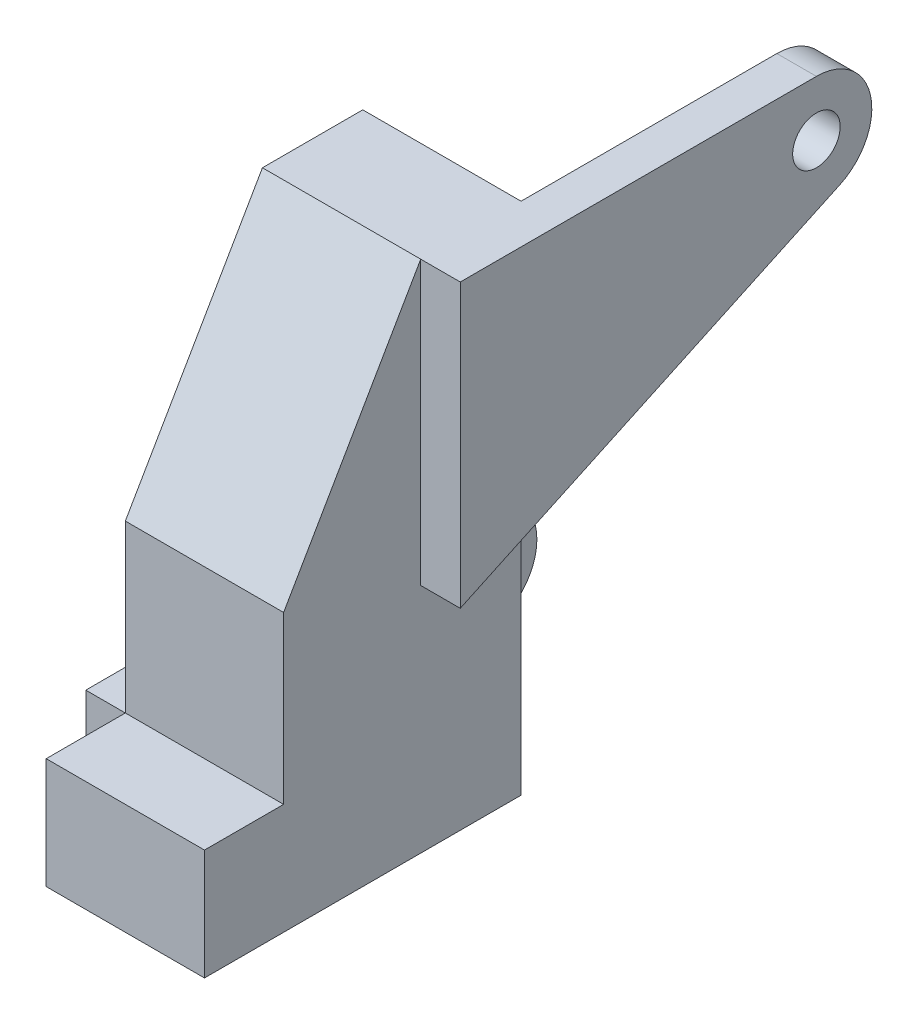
from build123d import *

# Parameters (mm, degrees)
BOSS_EXTRUDE3_DEPTH = 20
SKETCH6_R           = 3
BOSS_EXTRUDE4_DEPTH = 5
SKETCH7_R           = 3.5
BOSS_EXTRUDE5_DEPTH = 5


with BuildPart() as part:
    # Sketch5 → Boss-Extrude3 (new body)
    with BuildSketch(Plane(origin=(0, 0, 0), x_dir=(0, 0, -1), z_dir=(1, 0, 0))):
        Polygon((0, 0), (0, 14), (10, 14), (10, 35), (27.320508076, 65), (40, 65), (40, 0), align=None)
    extrude(amount=BOSS_EXTRUDE3_DEPTH)

    # Sketch6 → Boss-Extrude4 (add)
    with BuildSketch(Plane(origin=(20, 0, 0), x_dir=(0, 0, -1), z_dir=(1, 0, 0))):
        with BuildLine():
            Line((27.320508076, 65), (27.320508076, 29.29250995))
            Line((27.320508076, 29.29250995), (75.278835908, 51.655845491))
            ThreePointArc((75.278835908, 51.655845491), (79.154580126, 59.515077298), (72.320508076, 65))
            Line((72.320508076, 65), (27.320508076, 65))
        make_face()
        with Locations((72.320508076, 58)):
            Circle(SKETCH6_R, mode=Mode.SUBTRACT)
    extrude(amount=BOSS_EXTRUDE4_DEPTH)

    # Sketch7 → Boss-Extrude5 (add)
    with BuildSketch(Plane.ZY):
        with BuildLine():
            Line((-10, 14), (-55, 14))
            ThreePointArc((-55, 14), (-62, 7), (-55, 0))
            Line((-55, 0), (-10, 0))
            Line((-10, 0), (-10, 14))
        make_face()
        with Locations((-55, 7)):
            Circle(SKETCH7_R, mode=Mode.SUBTRACT)
    extrude(amount=BOSS_EXTRUDE5_DEPTH)


solid = part.part
